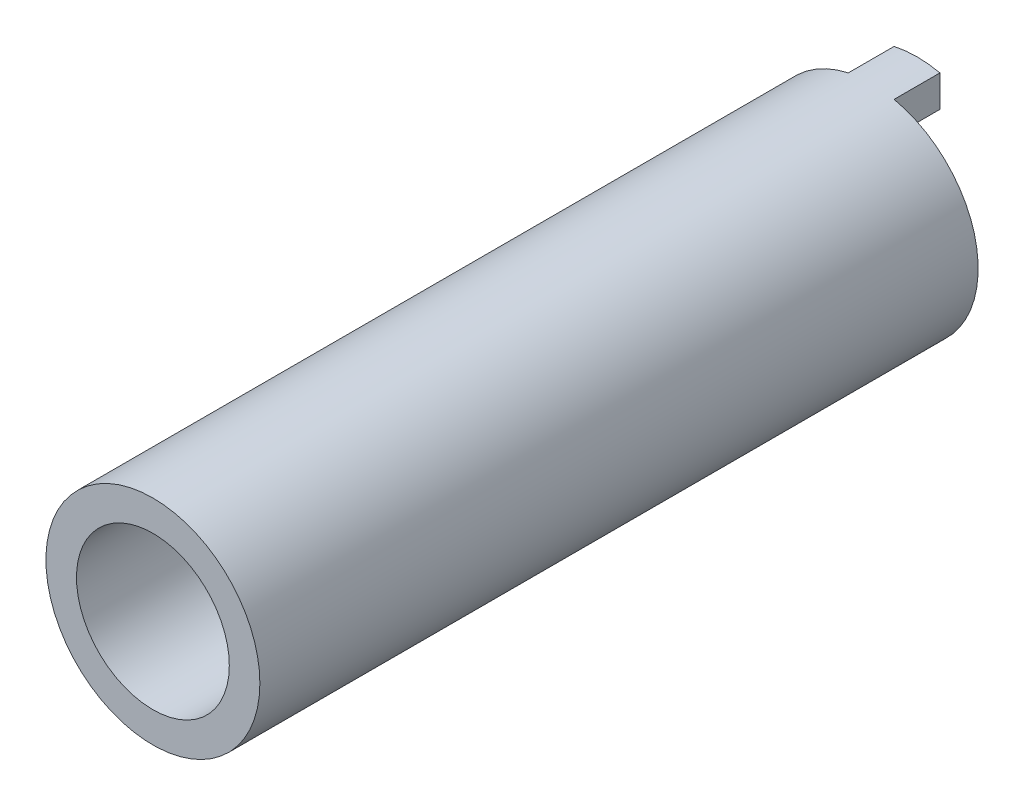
ISO-10303-21;
HEADER;
FILE_DESCRIPTION(('STEP AP214'),'2;1');
FILE_NAME('part.step','',(''),(''),'','','');
FILE_SCHEMA(('AUTOMOTIVE_DESIGN { 1 0 10303 214 1 1 1 1 }'));
ENDSEC;
DATA;
#1=APPLICATION_CONTEXT('core data for automotive mechanical design processes');
#2=APPLICATION_PROTOCOL_DEFINITION('international standard','automotive_design',2000,#1);
#3=PRODUCT_CONTEXT('',#1,'mechanical');
#4=PRODUCT('Part','Part','',(#3));
#5=PRODUCT_RELATED_PRODUCT_CATEGORY('part','',(#4));
#6=PRODUCT_DEFINITION_FORMATION('','',#4);
#7=PRODUCT_DEFINITION_CONTEXT('part definition',#1,'design');
#8=PRODUCT_DEFINITION('design','',#6,#7);
#9=PRODUCT_DEFINITION_SHAPE('','',#8);
#10=(LENGTH_UNIT() NAMED_UNIT(*) SI_UNIT(.MILLI.,.METRE.));
#11=(NAMED_UNIT(*) PLANE_ANGLE_UNIT() SI_UNIT($,.RADIAN.));
#12=(NAMED_UNIT(*) SI_UNIT($,.STERADIAN.) SOLID_ANGLE_UNIT());
#13=UNCERTAINTY_MEASURE_WITH_UNIT(LENGTH_MEASURE(1.E-05),#10,'distance_accuracy_value','');
#14=(GEOMETRIC_REPRESENTATION_CONTEXT(3) GLOBAL_UNCERTAINTY_ASSIGNED_CONTEXT((#13)) GLOBAL_UNIT_ASSIGNED_CONTEXT((#10,
#11,#12)) REPRESENTATION_CONTEXT('',''));
#15=CARTESIAN_POINT('',(0.,0.,0.));
#16=DIRECTION('',(0.,0.,1.));
#17=DIRECTION('',(1.,0.,0.));
#18=AXIS2_PLACEMENT_3D('',#15,#16,#17);
#19=CARTESIAN_POINT('',(0.,0.,0.));
#20=DIRECTION('',(0.,0.,1.));
#21=DIRECTION('',(1.,0.,0.));
#22=AXIS2_PLACEMENT_3D('',#19,#20,#21);
#23=PLANE('',#22);
#24=DIRECTION('',(0.,-1.,0.));
#25=VECTOR('',#24,1.);
#26=CARTESIAN_POINT('',(-1.5,0.,0.));
#27=LINE('',#26,#25);
#28=CARTESIAN_POINT('',(-1.5,6.83739716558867,0.));
#29=VERTEX_POINT('',#28);
#30=CARTESIAN_POINT('',(-1.50000000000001,4.76969600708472,0.));
#31=VERTEX_POINT('',#30);
#32=EDGE_CURVE('E123',#29,#31,#27,.T.);
#33=ORIENTED_EDGE('',*,*,#32,.F.);
#34=CARTESIAN_POINT('',(0.,0.,0.));
#35=DIRECTION('',(0.,0.,1.));
#36=DIRECTION('',(1.,0.,0.));
#37=AXIS2_PLACEMENT_3D('',#34,#35,#36);
#38=CIRCLE('',#37,7.);
#39=CARTESIAN_POINT('',(1.5,6.83739716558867,0.));
#40=VERTEX_POINT('',#39);
#41=EDGE_CURVE('E122',#40,#29,#38,.T.);
#42=ORIENTED_EDGE('',*,*,#41,.F.);
#43=DIRECTION('',(0.,1.,0.));
#44=VECTOR('',#43,1.);
#45=CARTESIAN_POINT('',(1.5,0.,0.));
#46=LINE('',#45,#44);
#47=CARTESIAN_POINT('',(1.50000000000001,4.76969600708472,0.));
#48=VERTEX_POINT('',#47);
#49=EDGE_CURVE('E133',#48,#40,#46,.T.);
#50=ORIENTED_EDGE('',*,*,#49,.F.);
#51=CARTESIAN_POINT('',(0.,0.,0.));
#52=DIRECTION('',(0.,0.,1.));
#53=DIRECTION('',(1.,0.,0.));
#54=AXIS2_PLACEMENT_3D('',#51,#52,#53);
#55=CIRCLE('',#54,5.);
#56=EDGE_CURVE('E146',#48,#31,#55,.T.);
#57=ORIENTED_EDGE('',*,*,#56,.T.);
#58=EDGE_LOOP('',(#33,#42,#50,#57));
#59=FACE_BOUND('',#58,.T.);
#60=ADVANCED_FACE('F39',(#59),#23,.F.);
#61=CARTESIAN_POINT('',(-1.50000000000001,-4.76969600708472,0.));
#62=VERTEX_POINT('',#61);
#63=CARTESIAN_POINT('',(-1.5,-6.83739716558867,0.));
#64=VERTEX_POINT('',#63);
#65=EDGE_CURVE('E117',#62,#64,#27,.T.);
#66=ORIENTED_EDGE('',*,*,#65,.F.);
#67=CARTESIAN_POINT('',(1.50000000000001,-4.76969600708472,0.));
#68=VERTEX_POINT('',#67);
#69=EDGE_CURVE('E141',#62,#68,#55,.T.);
#70=ORIENTED_EDGE('',*,*,#69,.T.);
#71=CARTESIAN_POINT('',(1.5,-6.83739716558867,0.));
#72=VERTEX_POINT('',#71);
#73=EDGE_CURVE('E136',#72,#68,#46,.T.);
#74=ORIENTED_EDGE('',*,*,#73,.F.);
#75=EDGE_CURVE('E145',#64,#72,#38,.T.);
#76=ORIENTED_EDGE('',*,*,#75,.F.);
#77=EDGE_LOOP('',(#66,#70,#74,#76));
#78=FACE_BOUND('',#77,.T.);
#79=ADVANCED_FACE('F172',(#78),#23,.F.);
#80=CARTESIAN_POINT('',(0.,0.,50.));
#81=DIRECTION('',(0.,0.,-1.));
#82=DIRECTION('',(-1.,0.,0.));
#83=AXIS2_PLACEMENT_3D('',#80,#81,#82);
#84=CYLINDRICAL_SURFACE('',#83,7.);
#85=CARTESIAN_POINT('',(0.,0.,50.));
#86=DIRECTION('',(0.,0.,1.));
#87=DIRECTION('',(1.,0.,0.));
#88=AXIS2_PLACEMENT_3D('',#85,#86,#87);
#89=CIRCLE('',#88,7.);
#90=CARTESIAN_POINT('',(7.,0.,50.));
#91=VERTEX_POINT('',#90);
#92=EDGE_CURVE('E149',#91,#91,#89,.T.);
#93=ORIENTED_EDGE('',*,*,#92,.F.);
#94=EDGE_LOOP('',(#93));
#95=FACE_BOUND('',#94,.T.);
#96=DIRECTION('',(0.,0.,-1.));
#97=VECTOR('',#96,1.);
#98=CARTESIAN_POINT('',(-1.50000000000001,6.83739716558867,50.));
#99=LINE('',#98,#97);
#100=CARTESIAN_POINT('',(-1.5,6.83739716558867,3.));
#101=VERTEX_POINT('',#100);
#102=EDGE_CURVE('E112',#101,#29,#99,.T.);
#103=ORIENTED_EDGE('',*,*,#102,.F.);
#104=CARTESIAN_POINT('',(0.,0.,3.));
#105=DIRECTION('',(0.,0.,-1.));
#106=DIRECTION('',(-1.,0.,0.));
#107=AXIS2_PLACEMENT_3D('',#104,#105,#106);
#108=CIRCLE('',#107,7.);
#109=CARTESIAN_POINT('',(-1.5,-6.83739716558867,3.));
#110=VERTEX_POINT('',#109);
#111=EDGE_CURVE('E104',#110,#101,#108,.T.);
#112=ORIENTED_EDGE('',*,*,#111,.F.);
#113=DIRECTION('',(0.,0.,-1.));
#114=VECTOR('',#113,1.);
#115=CARTESIAN_POINT('',(-1.50000000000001,-6.83739716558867,50.));
#116=LINE('',#115,#114);
#117=EDGE_CURVE('E125',#64,#110,#116,.F.);
#118=ORIENTED_EDGE('',*,*,#117,.F.);
#119=ORIENTED_EDGE('',*,*,#75,.T.);
#120=DIRECTION('',(0.,0.,-1.));
#121=VECTOR('',#120,1.);
#122=CARTESIAN_POINT('',(1.50000000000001,-6.83739716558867,50.));
#123=LINE('',#122,#121);
#124=CARTESIAN_POINT('',(1.5,-6.83739716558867,3.));
#125=VERTEX_POINT('',#124);
#126=EDGE_CURVE('E138',#125,#72,#123,.T.);
#127=ORIENTED_EDGE('',*,*,#126,.F.);
#128=CARTESIAN_POINT('',(0.,0.,3.));
#129=DIRECTION('',(0.,0.,-1.));
#130=DIRECTION('',(-1.,0.,0.));
#131=AXIS2_PLACEMENT_3D('',#128,#129,#130);
#132=CIRCLE('',#131,7.);
#133=CARTESIAN_POINT('',(1.5,6.83739716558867,3.));
#134=VERTEX_POINT('',#133);
#135=EDGE_CURVE('E131',#134,#125,#132,.T.);
#136=ORIENTED_EDGE('',*,*,#135,.F.);
#137=DIRECTION('',(0.,0.,-1.));
#138=VECTOR('',#137,1.);
#139=CARTESIAN_POINT('',(1.50000000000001,6.83739716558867,50.));
#140=LINE('',#139,#138);
#141=EDGE_CURVE('E135',#40,#134,#140,.F.);
#142=ORIENTED_EDGE('',*,*,#141,.F.);
#143=ORIENTED_EDGE('',*,*,#41,.T.);
#144=EDGE_LOOP('',(#103,#112,#118,#119,#127,#136,#142,#143));
#145=FACE_BOUND('',#144,.T.);
#146=ADVANCED_FACE('F41',(#95,#145),#84,.T.);
#147=CARTESIAN_POINT('',(0.,0.,50.));
#148=DIRECTION('',(0.,0.,-1.));
#149=DIRECTION('',(-1.,0.,0.));
#150=AXIS2_PLACEMENT_3D('',#147,#148,#149);
#151=CYLINDRICAL_SURFACE('',#150,5.);
#152=CARTESIAN_POINT('',(0.,0.,50.));
#153=DIRECTION('',(0.,0.,1.));
#154=DIRECTION('',(1.,0.,0.));
#155=AXIS2_PLACEMENT_3D('',#152,#153,#154);
#156=CIRCLE('',#155,5.);
#157=CARTESIAN_POINT('',(5.,0.,50.));
#158=VERTEX_POINT('',#157);
#159=EDGE_CURVE('E142',#158,#158,#156,.T.);
#160=ORIENTED_EDGE('',*,*,#159,.T.);
#161=EDGE_LOOP('',(#160));
#162=FACE_BOUND('',#161,.T.);
#163=CARTESIAN_POINT('',(0.,0.,3.));
#164=DIRECTION('',(0.,0.,-1.));
#165=DIRECTION('',(-1.,0.,0.));
#166=AXIS2_PLACEMENT_3D('',#163,#164,#165);
#167=CIRCLE('',#166,5.);
#168=CARTESIAN_POINT('',(-1.50000000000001,-4.76969600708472,3.));
#169=VERTEX_POINT('',#168);
#170=CARTESIAN_POINT('',(-1.5,4.76969600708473,3.));
#171=VERTEX_POINT('',#170);
#172=EDGE_CURVE('E47',#169,#171,#167,.T.);
#173=ORIENTED_EDGE('',*,*,#172,.T.);
#174=DIRECTION('',(0.,0.,-1.));
#175=VECTOR('',#174,1.);
#176=CARTESIAN_POINT('',(-1.50000000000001,4.76969600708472,50.));
#177=LINE('',#176,#175);
#178=EDGE_CURVE('E12',#171,#31,#177,.T.);
#179=ORIENTED_EDGE('',*,*,#178,.T.);
#180=ORIENTED_EDGE('',*,*,#56,.F.);
#181=DIRECTION('',(0.,0.,-1.));
#182=VECTOR('',#181,1.);
#183=CARTESIAN_POINT('',(1.50000000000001,4.76969600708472,50.));
#184=LINE('',#183,#182);
#185=CARTESIAN_POINT('',(1.5,4.76969600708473,3.));
#186=VERTEX_POINT('',#185);
#187=EDGE_CURVE('E156',#48,#186,#184,.F.);
#188=ORIENTED_EDGE('',*,*,#187,.T.);
#189=CARTESIAN_POINT('',(0.,0.,3.));
#190=DIRECTION('',(0.,0.,-1.));
#191=DIRECTION('',(-1.,0.,0.));
#192=AXIS2_PLACEMENT_3D('',#189,#190,#191);
#193=CIRCLE('',#192,5.);
#194=CARTESIAN_POINT('',(1.5,-4.76969600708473,3.));
#195=VERTEX_POINT('',#194);
#196=EDGE_CURVE('E152',#186,#195,#193,.T.);
#197=ORIENTED_EDGE('',*,*,#196,.T.);
#198=DIRECTION('',(0.,0.,-1.));
#199=VECTOR('',#198,1.);
#200=CARTESIAN_POINT('',(1.50000000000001,-4.76969600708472,50.));
#201=LINE('',#200,#199);
#202=EDGE_CURVE('E159',#195,#68,#201,.T.);
#203=ORIENTED_EDGE('',*,*,#202,.T.);
#204=ORIENTED_EDGE('',*,*,#69,.F.);
#205=DIRECTION('',(0.,0.,-1.));
#206=VECTOR('',#205,1.);
#207=CARTESIAN_POINT('',(-1.50000000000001,-4.76969600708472,50.));
#208=LINE('',#207,#206);
#209=EDGE_CURVE('E162',#62,#169,#208,.F.);
#210=ORIENTED_EDGE('',*,*,#209,.T.);
#211=EDGE_LOOP('',(#173,#179,#180,#188,#197,#203,#204,#210));
#212=FACE_BOUND('',#211,.T.);
#213=ADVANCED_FACE('F165',(#162,#212),#151,.F.);
#214=CARTESIAN_POINT('',(0.,0.,50.));
#215=DIRECTION('',(0.,0.,1.));
#216=DIRECTION('',(1.,0.,0.));
#217=AXIS2_PLACEMENT_3D('',#214,#215,#216);
#218=PLANE('',#217);
#219=ORIENTED_EDGE('',*,*,#92,.T.);
#220=EDGE_LOOP('',(#219));
#221=FACE_BOUND('',#220,.T.);
#222=ORIENTED_EDGE('',*,*,#159,.F.);
#223=EDGE_LOOP('',(#222));
#224=FACE_BOUND('',#223,.T.);
#225=ADVANCED_FACE('F191',(#221,#224),#218,.T.);
#226=CARTESIAN_POINT('',(1.5,50.,-2.67314200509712));
#227=DIRECTION('',(1.,0.,0.));
#228=DIRECTION('',(0.,0.,-1.));
#229=AXIS2_PLACEMENT_3D('',#226,#227,#228);
#230=PLANE('',#229);
#231=ORIENTED_EDGE('',*,*,#126,.T.);
#232=ORIENTED_EDGE('',*,*,#73,.T.);
#233=ORIENTED_EDGE('',*,*,#202,.F.);
#234=DIRECTION('',(0.,-1.,0.));
#235=VECTOR('',#234,1.);
#236=CARTESIAN_POINT('',(1.5,50.,3.));
#237=LINE('',#236,#235);
#238=EDGE_CURVE('E62',#195,#125,#237,.T.);
#239=ORIENTED_EDGE('',*,*,#238,.T.);
#240=EDGE_LOOP('',(#231,#232,#233,#239));
#241=FACE_BOUND('',#240,.T.);
#242=ADVANCED_FACE('F178',(#241),#230,.T.);
#243=ORIENTED_EDGE('',*,*,#141,.T.);
#244=EDGE_CURVE('E130',#134,#186,#237,.T.);
#245=ORIENTED_EDGE('',*,*,#244,.T.);
#246=ORIENTED_EDGE('',*,*,#187,.F.);
#247=ORIENTED_EDGE('',*,*,#49,.T.);
#248=EDGE_LOOP('',(#243,#245,#246,#247));
#249=FACE_BOUND('',#248,.T.);
#250=ADVANCED_FACE('F183',(#249),#230,.T.);
#251=CARTESIAN_POINT('',(1.5,50.,3.));
#252=DIRECTION('',(0.,0.,-1.));
#253=DIRECTION('',(-1.,0.,0.));
#254=AXIS2_PLACEMENT_3D('',#251,#252,#253);
#255=PLANE('',#254);
#256=ORIENTED_EDGE('',*,*,#135,.T.);
#257=ORIENTED_EDGE('',*,*,#238,.F.);
#258=ORIENTED_EDGE('',*,*,#196,.F.);
#259=ORIENTED_EDGE('',*,*,#244,.F.);
#260=EDGE_LOOP('',(#256,#257,#258,#259));
#261=FACE_BOUND('',#260,.T.);
#262=ADVANCED_FACE('F181',(#261),#255,.T.);
#263=CARTESIAN_POINT('',(-1.5,50.,3.));
#264=DIRECTION('',(0.,0.,-1.));
#265=DIRECTION('',(-1.,0.,0.));
#266=AXIS2_PLACEMENT_3D('',#263,#264,#265);
#267=PLANE('',#266);
#268=ORIENTED_EDGE('',*,*,#111,.T.);
#269=DIRECTION('',(0.,-1.,0.));
#270=VECTOR('',#269,1.);
#271=CARTESIAN_POINT('',(-1.5,50.,3.));
#272=LINE('',#271,#270);
#273=EDGE_CURVE('E107',#101,#171,#272,.T.);
#274=ORIENTED_EDGE('',*,*,#273,.T.);
#275=ORIENTED_EDGE('',*,*,#172,.F.);
#276=EDGE_CURVE('E54',#169,#110,#272,.T.);
#277=ORIENTED_EDGE('',*,*,#276,.T.);
#278=EDGE_LOOP('',(#268,#274,#275,#277));
#279=FACE_BOUND('',#278,.T.);
#280=ADVANCED_FACE('F106',(#279),#267,.T.);
#281=CARTESIAN_POINT('',(-1.5,50.,-2.67314200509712));
#282=DIRECTION('',(-1.,0.,0.));
#283=DIRECTION('',(0.,0.,1.));
#284=AXIS2_PLACEMENT_3D('',#281,#282,#283);
#285=PLANE('',#284);
#286=ORIENTED_EDGE('',*,*,#102,.T.);
#287=ORIENTED_EDGE('',*,*,#32,.T.);
#288=ORIENTED_EDGE('',*,*,#178,.F.);
#289=ORIENTED_EDGE('',*,*,#273,.F.);
#290=EDGE_LOOP('',(#286,#287,#288,#289));
#291=FACE_BOUND('',#290,.T.);
#292=ADVANCED_FACE('F115',(#291),#285,.T.);
#293=ORIENTED_EDGE('',*,*,#117,.T.);
#294=ORIENTED_EDGE('',*,*,#276,.F.);
#295=ORIENTED_EDGE('',*,*,#209,.F.);
#296=ORIENTED_EDGE('',*,*,#65,.T.);
#297=EDGE_LOOP('',(#293,#294,#295,#296));
#298=FACE_BOUND('',#297,.T.);
#299=ADVANCED_FACE('F169',(#298),#285,.T.);
#300=CLOSED_SHELL('',(#60,#79,#146,#213,#225,#242,#250,#262,#280,#292,#299));
#301=MANIFOLD_SOLID_BREP('B2',#300);
#302=ADVANCED_BREP_SHAPE_REPRESENTATION('',(#18,#301),#14);
#303=SHAPE_DEFINITION_REPRESENTATION(#9,#302);
ENDSEC;
END-ISO-10303-21;
